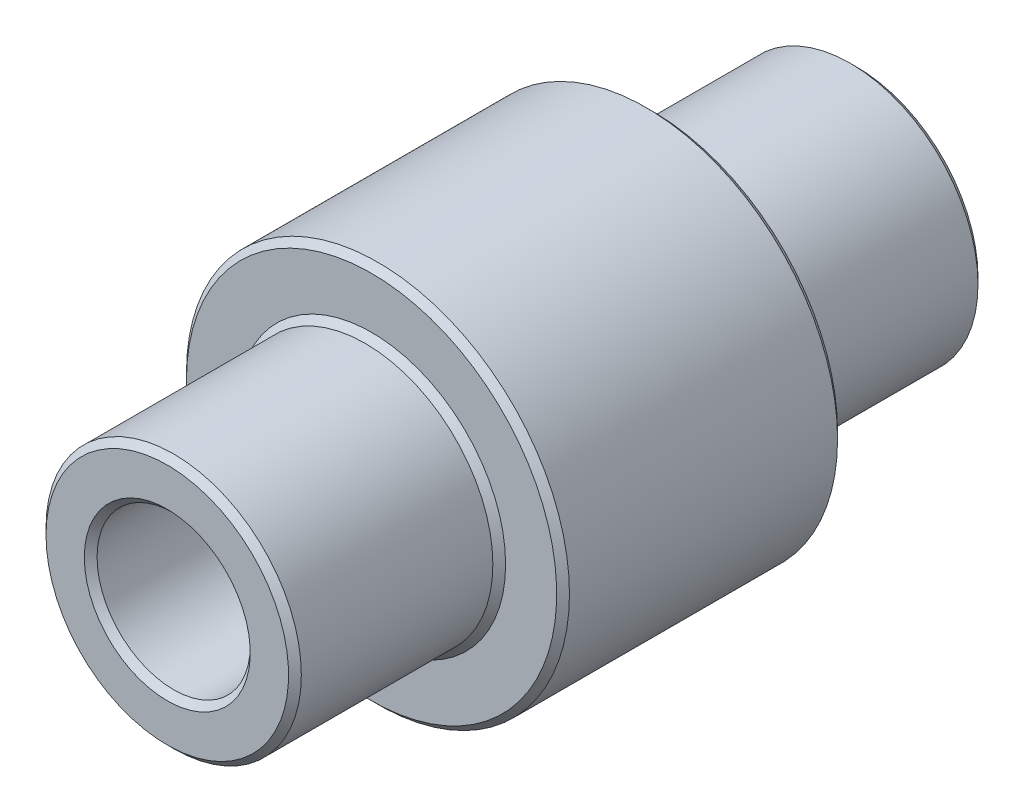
ISO-10303-21;
HEADER;
FILE_DESCRIPTION(('STEP AP214'),'2;1');
FILE_NAME('part.step','',(''),(''),'','','');
FILE_SCHEMA(('AUTOMOTIVE_DESIGN { 1 0 10303 214 1 1 1 1 }'));
ENDSEC;
DATA;
#1=APPLICATION_CONTEXT('core data for automotive mechanical design processes');
#2=APPLICATION_PROTOCOL_DEFINITION('international standard','automotive_design',2000,#1);
#3=PRODUCT_CONTEXT('',#1,'mechanical');
#4=PRODUCT('Part','Part','',(#3));
#5=PRODUCT_RELATED_PRODUCT_CATEGORY('part','',(#4));
#6=PRODUCT_DEFINITION_FORMATION('','',#4);
#7=PRODUCT_DEFINITION_CONTEXT('part definition',#1,'design');
#8=PRODUCT_DEFINITION('design','',#6,#7);
#9=PRODUCT_DEFINITION_SHAPE('','',#8);
#10=(LENGTH_UNIT() NAMED_UNIT(*) SI_UNIT(.MILLI.,.METRE.));
#11=(NAMED_UNIT(*) PLANE_ANGLE_UNIT() SI_UNIT($,.RADIAN.));
#12=(NAMED_UNIT(*) SI_UNIT($,.STERADIAN.) SOLID_ANGLE_UNIT());
#13=UNCERTAINTY_MEASURE_WITH_UNIT(LENGTH_MEASURE(1.E-05),#10,'distance_accuracy_value','');
#14=(GEOMETRIC_REPRESENTATION_CONTEXT(3) GLOBAL_UNCERTAINTY_ASSIGNED_CONTEXT((#13)) GLOBAL_UNIT_ASSIGNED_CONTEXT((#10,
#11,#12)) REPRESENTATION_CONTEXT('',''));
#15=CARTESIAN_POINT('',(0.,0.,0.));
#16=DIRECTION('',(0.,0.,1.));
#17=DIRECTION('',(1.,0.,0.));
#18=AXIS2_PLACEMENT_3D('',#15,#16,#17);
#19=CARTESIAN_POINT('',(0.,0.,27.));
#20=DIRECTION('',(0.,0.,1.));
#21=DIRECTION('',(1.,0.,0.));
#22=AXIS2_PLACEMENT_3D('',#19,#20,#21);
#23=CYLINDRICAL_SURFACE('',#22,5.99999999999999);
#24=CARTESIAN_POINT('',(0.,0.,26.5));
#25=DIRECTION('',(0.,0.,-1.));
#26=DIRECTION('',(-1.,0.,0.));
#27=AXIS2_PLACEMENT_3D('',#24,#25,#26);
#28=CIRCLE('',#27,5.99999999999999);
#29=CARTESIAN_POINT('',(-5.99999999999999,0.,26.5));
#30=VERTEX_POINT('',#29);
#31=EDGE_CURVE('E10',#30,#30,#28,.F.);
#32=ORIENTED_EDGE('',*,*,#31,.T.);
#33=EDGE_LOOP('',(#32));
#34=FACE_BOUND('',#33,.T.);
#35=CARTESIAN_POINT('',(0.,0.,-26.5));
#36=DIRECTION('',(0.,0.,1.));
#37=DIRECTION('',(1.,0.,0.));
#38=AXIS2_PLACEMENT_3D('',#35,#36,#37);
#39=CIRCLE('',#38,5.99999999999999);
#40=CARTESIAN_POINT('',(5.99999999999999,0.,-26.5));
#41=VERTEX_POINT('',#40);
#42=EDGE_CURVE('E36',#41,#41,#39,.F.);
#43=ORIENTED_EDGE('',*,*,#42,.T.);
#44=EDGE_LOOP('',(#43));
#45=FACE_BOUND('',#44,.T.);
#46=ADVANCED_FACE('F29',(#34,#45),#23,.F.);
#47=CARTESIAN_POINT('',(0.,5.99999999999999,27.));
#48=DIRECTION('',(0.,0.,-1.));
#49=DIRECTION('',(-1.,0.,0.));
#50=AXIS2_PLACEMENT_3D('',#47,#48,#49);
#51=PLANE('',#50);
#52=CARTESIAN_POINT('',(0.,0.,27.));
#53=DIRECTION('',(0.,0.,-1.));
#54=DIRECTION('',(-1.,0.,0.));
#55=AXIS2_PLACEMENT_3D('',#52,#53,#54);
#56=CIRCLE('',#55,9.5);
#57=CARTESIAN_POINT('',(-9.5,0.,27.));
#58=VERTEX_POINT('',#57);
#59=EDGE_CURVE('E40',#58,#58,#56,.F.);
#60=ORIENTED_EDGE('',*,*,#59,.T.);
#61=EDGE_LOOP('',(#60));
#62=FACE_BOUND('',#61,.T.);
#63=CARTESIAN_POINT('',(0.,0.,27.));
#64=DIRECTION('',(0.,0.,-1.));
#65=DIRECTION('',(-1.,0.,0.));
#66=AXIS2_PLACEMENT_3D('',#63,#64,#65);
#67=CIRCLE('',#66,6.49999999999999);
#68=CARTESIAN_POINT('',(-6.49999999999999,0.,27.));
#69=VERTEX_POINT('',#68);
#70=EDGE_CURVE('E44',#69,#69,#67,.T.);
#71=ORIENTED_EDGE('',*,*,#70,.T.);
#72=EDGE_LOOP('',(#71));
#73=FACE_BOUND('',#72,.T.);
#74=ADVANCED_FACE('F113',(#62,#73),#51,.F.);
#75=CARTESIAN_POINT('',(0.,0.,27.));
#76=DIRECTION('',(0.,0.,1.));
#77=DIRECTION('',(1.,0.,0.));
#78=AXIS2_PLACEMENT_3D('',#75,#76,#77);
#79=CYLINDRICAL_SURFACE('',#78,10.);
#80=CARTESIAN_POINT('',(0.,0.,11.5));
#81=DIRECTION('',(0.,0.,-1.));
#82=DIRECTION('',(-1.,0.,0.));
#83=AXIS2_PLACEMENT_3D('',#80,#81,#82);
#84=CIRCLE('',#83,10.);
#85=CARTESIAN_POINT('',(-10.,0.,11.5));
#86=VERTEX_POINT('',#85);
#87=EDGE_CURVE('E49',#86,#86,#84,.F.);
#88=ORIENTED_EDGE('',*,*,#87,.T.);
#89=EDGE_LOOP('',(#88));
#90=FACE_BOUND('',#89,.T.);
#91=CARTESIAN_POINT('',(0.,0.,26.5));
#92=DIRECTION('',(0.,0.,-1.));
#93=DIRECTION('',(-1.,0.,0.));
#94=AXIS2_PLACEMENT_3D('',#91,#92,#93);
#95=CIRCLE('',#94,10.);
#96=CARTESIAN_POINT('',(-10.,0.,26.5));
#97=VERTEX_POINT('',#96);
#98=EDGE_CURVE('E52',#97,#97,#95,.T.);
#99=ORIENTED_EDGE('',*,*,#98,.T.);
#100=EDGE_LOOP('',(#99));
#101=FACE_BOUND('',#100,.T.);
#102=ADVANCED_FACE('F99',(#90,#101),#79,.T.);
#103=CARTESIAN_POINT('',(0.,10.,11.));
#104=DIRECTION('',(0.,0.,-1.));
#105=DIRECTION('',(-1.,0.,0.));
#106=AXIS2_PLACEMENT_3D('',#103,#104,#105);
#107=PLANE('',#106);
#108=CARTESIAN_POINT('',(0.,0.,11.));
#109=DIRECTION('',(0.,0.,-1.));
#110=DIRECTION('',(-1.,0.,0.));
#111=AXIS2_PLACEMENT_3D('',#108,#109,#110);
#112=CIRCLE('',#111,14.5);
#113=CARTESIAN_POINT('',(-14.5,0.,11.));
#114=VERTEX_POINT('',#113);
#115=EDGE_CURVE('E67',#114,#114,#112,.F.);
#116=ORIENTED_EDGE('',*,*,#115,.T.);
#117=EDGE_LOOP('',(#116));
#118=FACE_BOUND('',#117,.T.);
#119=CARTESIAN_POINT('',(0.,0.,11.));
#120=DIRECTION('',(0.,0.,-1.));
#121=DIRECTION('',(-1.,0.,0.));
#122=AXIS2_PLACEMENT_3D('',#119,#120,#121);
#123=CIRCLE('',#122,10.5);
#124=CARTESIAN_POINT('',(-10.5,0.,11.));
#125=VERTEX_POINT('',#124);
#126=EDGE_CURVE('E70',#125,#125,#123,.T.);
#127=ORIENTED_EDGE('',*,*,#126,.T.);
#128=EDGE_LOOP('',(#127));
#129=FACE_BOUND('',#128,.T.);
#130=ADVANCED_FACE('F96',(#118,#129),#107,.F.);
#131=CARTESIAN_POINT('',(0.,0.,27.));
#132=DIRECTION('',(0.,0.,1.));
#133=DIRECTION('',(1.,0.,0.));
#134=AXIS2_PLACEMENT_3D('',#131,#132,#133);
#135=CYLINDRICAL_SURFACE('',#134,15.);
#136=CARTESIAN_POINT('',(0.,0.,-10.5));
#137=DIRECTION('',(0.,0.,1.));
#138=DIRECTION('',(1.,0.,0.));
#139=AXIS2_PLACEMENT_3D('',#136,#137,#138);
#140=CIRCLE('',#139,15.);
#141=CARTESIAN_POINT('',(15.,0.,-10.5));
#142=VERTEX_POINT('',#141);
#143=EDGE_CURVE('E79',#142,#142,#140,.T.);
#144=ORIENTED_EDGE('',*,*,#143,.T.);
#145=EDGE_LOOP('',(#144));
#146=FACE_BOUND('',#145,.T.);
#147=CARTESIAN_POINT('',(0.,0.,10.5));
#148=DIRECTION('',(0.,0.,-1.));
#149=DIRECTION('',(-1.,0.,0.));
#150=AXIS2_PLACEMENT_3D('',#147,#148,#149);
#151=CIRCLE('',#150,15.);
#152=CARTESIAN_POINT('',(-15.,0.,10.5));
#153=VERTEX_POINT('',#152);
#154=EDGE_CURVE('E82',#153,#153,#151,.T.);
#155=ORIENTED_EDGE('',*,*,#154,.T.);
#156=EDGE_LOOP('',(#155));
#157=FACE_BOUND('',#156,.T.);
#158=ADVANCED_FACE('F86',(#146,#157),#135,.T.);
#159=CARTESIAN_POINT('',(0.,15.,-11.));
#160=DIRECTION('',(0.,0.,1.));
#161=DIRECTION('',(1.,0.,0.));
#162=AXIS2_PLACEMENT_3D('',#159,#160,#161);
#163=PLANE('',#162);
#164=CARTESIAN_POINT('',(0.,0.,-11.));
#165=DIRECTION('',(0.,0.,1.));
#166=DIRECTION('',(1.,0.,0.));
#167=AXIS2_PLACEMENT_3D('',#164,#165,#166);
#168=CIRCLE('',#167,14.5);
#169=CARTESIAN_POINT('',(14.5,0.,-11.));
#170=VERTEX_POINT('',#169);
#171=EDGE_CURVE('E73',#170,#170,#168,.F.);
#172=ORIENTED_EDGE('',*,*,#171,.T.);
#173=EDGE_LOOP('',(#172));
#174=FACE_BOUND('',#173,.T.);
#175=CARTESIAN_POINT('',(0.,0.,-11.));
#176=DIRECTION('',(0.,0.,1.));
#177=DIRECTION('',(1.,0.,0.));
#178=AXIS2_PLACEMENT_3D('',#175,#176,#177);
#179=CIRCLE('',#178,10.5);
#180=CARTESIAN_POINT('',(10.5,0.,-11.));
#181=VERTEX_POINT('',#180);
#182=EDGE_CURVE('E76',#181,#181,#179,.T.);
#183=ORIENTED_EDGE('',*,*,#182,.T.);
#184=EDGE_LOOP('',(#183));
#185=FACE_BOUND('',#184,.T.);
#186=ADVANCED_FACE('F154',(#174,#185),#163,.F.);
#187=CARTESIAN_POINT('',(0.,0.,27.));
#188=DIRECTION('',(0.,0.,1.));
#189=DIRECTION('',(1.,0.,0.));
#190=AXIS2_PLACEMENT_3D('',#187,#188,#189);
#191=CYLINDRICAL_SURFACE('',#190,10.);
#192=CARTESIAN_POINT('',(0.,0.,-26.5));
#193=DIRECTION('',(0.,0.,1.));
#194=DIRECTION('',(1.,0.,0.));
#195=AXIS2_PLACEMENT_3D('',#192,#193,#194);
#196=CIRCLE('',#195,10.);
#197=CARTESIAN_POINT('',(10.,0.,-26.5));
#198=VERTEX_POINT('',#197);
#199=EDGE_CURVE('E61',#198,#198,#196,.T.);
#200=ORIENTED_EDGE('',*,*,#199,.T.);
#201=EDGE_LOOP('',(#200));
#202=FACE_BOUND('',#201,.T.);
#203=CARTESIAN_POINT('',(0.,0.,-11.5));
#204=DIRECTION('',(0.,0.,1.));
#205=DIRECTION('',(1.,0.,0.));
#206=AXIS2_PLACEMENT_3D('',#203,#204,#205);
#207=CIRCLE('',#206,10.);
#208=CARTESIAN_POINT('',(10.,0.,-11.5));
#209=VERTEX_POINT('',#208);
#210=EDGE_CURVE('E64',#209,#209,#207,.F.);
#211=ORIENTED_EDGE('',*,*,#210,.T.);
#212=EDGE_LOOP('',(#211));
#213=FACE_BOUND('',#212,.T.);
#214=ADVANCED_FACE('F156',(#202,#213),#191,.T.);
#215=CARTESIAN_POINT('',(0.,10.,-27.));
#216=DIRECTION('',(0.,0.,1.));
#217=DIRECTION('',(1.,0.,0.));
#218=AXIS2_PLACEMENT_3D('',#215,#216,#217);
#219=PLANE('',#218);
#220=CARTESIAN_POINT('',(0.,0.,-27.));
#221=DIRECTION('',(0.,0.,1.));
#222=DIRECTION('',(1.,0.,0.));
#223=AXIS2_PLACEMENT_3D('',#220,#221,#222);
#224=CIRCLE('',#223,9.5);
#225=CARTESIAN_POINT('',(9.5,0.,-27.));
#226=VERTEX_POINT('',#225);
#227=EDGE_CURVE('E55',#226,#226,#224,.F.);
#228=ORIENTED_EDGE('',*,*,#227,.T.);
#229=EDGE_LOOP('',(#228));
#230=FACE_BOUND('',#229,.T.);
#231=CARTESIAN_POINT('',(0.,0.,-27.));
#232=DIRECTION('',(0.,0.,1.));
#233=DIRECTION('',(1.,0.,0.));
#234=AXIS2_PLACEMENT_3D('',#231,#232,#233);
#235=CIRCLE('',#234,6.49999999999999);
#236=CARTESIAN_POINT('',(6.49999999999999,0.,-27.));
#237=VERTEX_POINT('',#236);
#238=EDGE_CURVE('E58',#237,#237,#235,.T.);
#239=ORIENTED_EDGE('',*,*,#238,.T.);
#240=EDGE_LOOP('',(#239));
#241=FACE_BOUND('',#240,.T.);
#242=ADVANCED_FACE('F140',(#230,#241),#219,.F.);
#243=CARTESIAN_POINT('',(0.,0.,-10.5));
#244=DIRECTION('',(0.,0.,1.));
#245=DIRECTION('',(1.,0.,0.));
#246=AXIS2_PLACEMENT_3D('',#243,#244,#245);
#247=CONICAL_SURFACE('',#246,15.,0.785398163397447);
#248=ORIENTED_EDGE('',*,*,#171,.F.);
#249=EDGE_LOOP('',(#248));
#250=FACE_BOUND('',#249,.T.);
#251=ORIENTED_EDGE('',*,*,#143,.F.);
#252=EDGE_LOOP('',(#251));
#253=FACE_BOUND('',#252,.T.);
#254=ADVANCED_FACE('F92',(#250,#253),#247,.T.);
#255=CARTESIAN_POINT('',(0.,0.,11.));
#256=DIRECTION('',(0.,0.,-1.));
#257=DIRECTION('',(-1.,0.,0.));
#258=AXIS2_PLACEMENT_3D('',#255,#256,#257);
#259=CONICAL_SURFACE('',#258,14.5,0.785398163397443);
#260=ORIENTED_EDGE('',*,*,#154,.F.);
#261=EDGE_LOOP('',(#260));
#262=FACE_BOUND('',#261,.T.);
#263=ORIENTED_EDGE('',*,*,#115,.F.);
#264=EDGE_LOOP('',(#263));
#265=FACE_BOUND('',#264,.T.);
#266=ADVANCED_FACE('F88',(#262,#265),#259,.T.);
#267=CARTESIAN_POINT('',(0.,0.,-26.5));
#268=DIRECTION('',(0.,0.,1.));
#269=DIRECTION('',(1.,0.,0.));
#270=AXIS2_PLACEMENT_3D('',#267,#268,#269);
#271=CONICAL_SURFACE('',#270,10.,0.785398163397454);
#272=ORIENTED_EDGE('',*,*,#227,.F.);
#273=EDGE_LOOP('',(#272));
#274=FACE_BOUND('',#273,.T.);
#275=ORIENTED_EDGE('',*,*,#199,.F.);
#276=EDGE_LOOP('',(#275));
#277=FACE_BOUND('',#276,.T.);
#278=ADVANCED_FACE('F91',(#274,#277),#271,.T.);
#279=CARTESIAN_POINT('',(0.,0.,-11.));
#280=DIRECTION('',(0.,0.,1.));
#281=DIRECTION('',(1.,0.,0.));
#282=AXIS2_PLACEMENT_3D('',#279,#280,#281);
#283=CONICAL_SURFACE('',#282,10.5,0.78539816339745);
#284=ORIENTED_EDGE('',*,*,#210,.F.);
#285=EDGE_LOOP('',(#284));
#286=FACE_BOUND('',#285,.T.);
#287=ORIENTED_EDGE('',*,*,#182,.F.);
#288=EDGE_LOOP('',(#287));
#289=FACE_BOUND('',#288,.T.);
#290=ADVANCED_FACE('F107',(#286,#289),#283,.T.);
#291=CARTESIAN_POINT('',(0.,0.,11.5));
#292=DIRECTION('',(0.,0.,-1.));
#293=DIRECTION('',(-1.,0.,0.));
#294=AXIS2_PLACEMENT_3D('',#291,#292,#293);
#295=CONICAL_SURFACE('',#294,10.,0.78539816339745);
#296=ORIENTED_EDGE('',*,*,#126,.F.);
#297=EDGE_LOOP('',(#296));
#298=FACE_BOUND('',#297,.T.);
#299=ORIENTED_EDGE('',*,*,#87,.F.);
#300=EDGE_LOOP('',(#299));
#301=FACE_BOUND('',#300,.T.);
#302=ADVANCED_FACE('F103',(#298,#301),#295,.T.);
#303=CARTESIAN_POINT('',(0.,0.,27.));
#304=DIRECTION('',(0.,0.,-1.));
#305=DIRECTION('',(-1.,0.,0.));
#306=AXIS2_PLACEMENT_3D('',#303,#304,#305);
#307=CONICAL_SURFACE('',#306,9.5,0.785398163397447);
#308=ORIENTED_EDGE('',*,*,#98,.F.);
#309=EDGE_LOOP('',(#308));
#310=FACE_BOUND('',#309,.T.);
#311=ORIENTED_EDGE('',*,*,#59,.F.);
#312=EDGE_LOOP('',(#311));
#313=FACE_BOUND('',#312,.T.);
#314=ADVANCED_FACE('F106',(#310,#313),#307,.T.);
#315=CARTESIAN_POINT('',(0.,0.,26.5));
#316=DIRECTION('',(0.,0.,1.));
#317=DIRECTION('',(1.,0.,0.));
#318=AXIS2_PLACEMENT_3D('',#315,#316,#317);
#319=CONICAL_SURFACE('',#318,5.99999999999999,0.785398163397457);
#320=ORIENTED_EDGE('',*,*,#70,.F.);
#321=EDGE_LOOP('',(#320));
#322=FACE_BOUND('',#321,.T.);
#323=ORIENTED_EDGE('',*,*,#31,.F.);
#324=EDGE_LOOP('',(#323));
#325=FACE_BOUND('',#324,.T.);
#326=ADVANCED_FACE('F119',(#322,#325),#319,.F.);
#327=CARTESIAN_POINT('',(0.,0.,-27.));
#328=DIRECTION('',(0.,0.,-1.));
#329=DIRECTION('',(-1.,0.,0.));
#330=AXIS2_PLACEMENT_3D('',#327,#328,#329);
#331=CONICAL_SURFACE('',#330,6.49999999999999,0.785398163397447);
#332=ORIENTED_EDGE('',*,*,#42,.F.);
#333=EDGE_LOOP('',(#332));
#334=FACE_BOUND('',#333,.T.);
#335=ORIENTED_EDGE('',*,*,#238,.F.);
#336=EDGE_LOOP('',(#335));
#337=FACE_BOUND('',#336,.T.);
#338=ADVANCED_FACE('F31',(#334,#337),#331,.F.);
#339=CLOSED_SHELL('',(#46,#74,#102,#130,#158,#186,#214,#242,#254,#266,#278,#290,#302,#314,#326,#338));
#340=MANIFOLD_SOLID_BREP('B2',#339);
#341=ADVANCED_BREP_SHAPE_REPRESENTATION('',(#18,#340),#14);
#342=SHAPE_DEFINITION_REPRESENTATION(#9,#341);
ENDSEC;
END-ISO-10303-21;
